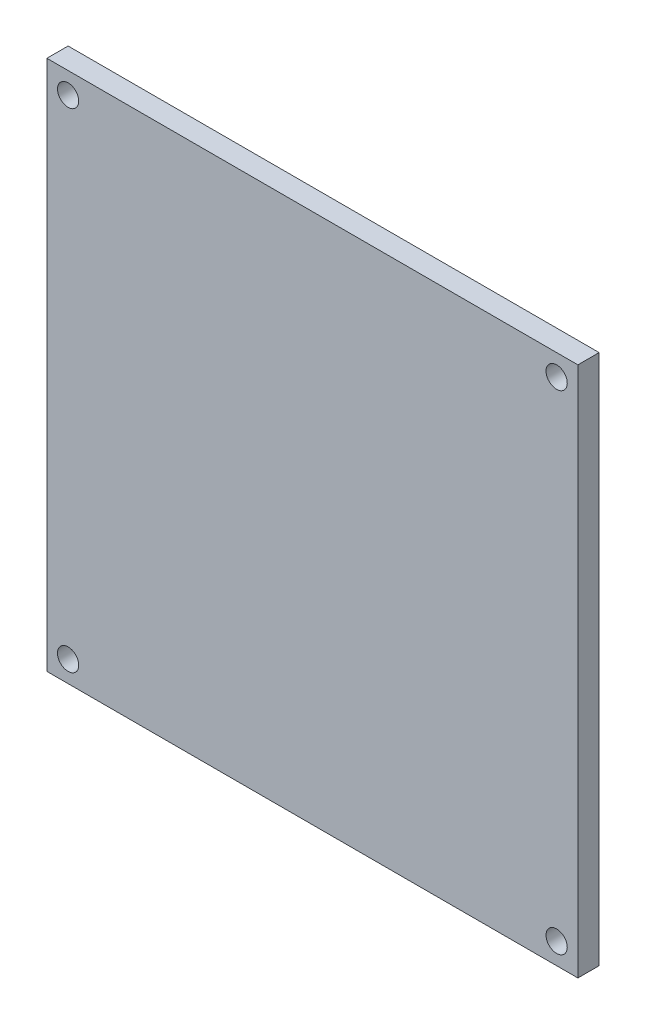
from build123d import *

# Parameters (mm, degrees)
SKETCH_1_W            = 250
SKETCH_1_H            = 250
EXTRUDE_1_DEPTH       = 10
M10X1_0_1_D           = 9
M10X1_0_1_DEPTH       = 25
M10X1_0_1_CBORE_D     = 10
M10X1_0_1_CBORE_DEPTH = 20
M10X1_0_1_TIP         = 2.703872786


with BuildPart() as part:
    # Sketch 1 → Extrude 1 (new body)
    with BuildSketch(Plane.XY):
        with Locations((125, -125)):
            Rectangle(SKETCH_1_W, SKETCH_1_H)
    extrude(amount=EXTRUDE_1_DEPTH)

    # M10x1.0 _1
    with Locations(Plane.XY.offset(10)):
        with Locations((10, -10), (240, -10), (10, -240), (240, -240)):
            CounterBoreHole(M10X1_0_1_D / 2, M10X1_0_1_CBORE_D / 2, M10X1_0_1_CBORE_DEPTH, depth=M10X1_0_1_DEPTH)
            with Locations((0, 0, -(M10X1_0_1_DEPTH + M10X1_0_1_TIP / 2))):  # 118° drill point
                Cone(0, M10X1_0_1_D / 2, M10X1_0_1_TIP, mode=Mode.SUBTRACT)


solid = part.part
